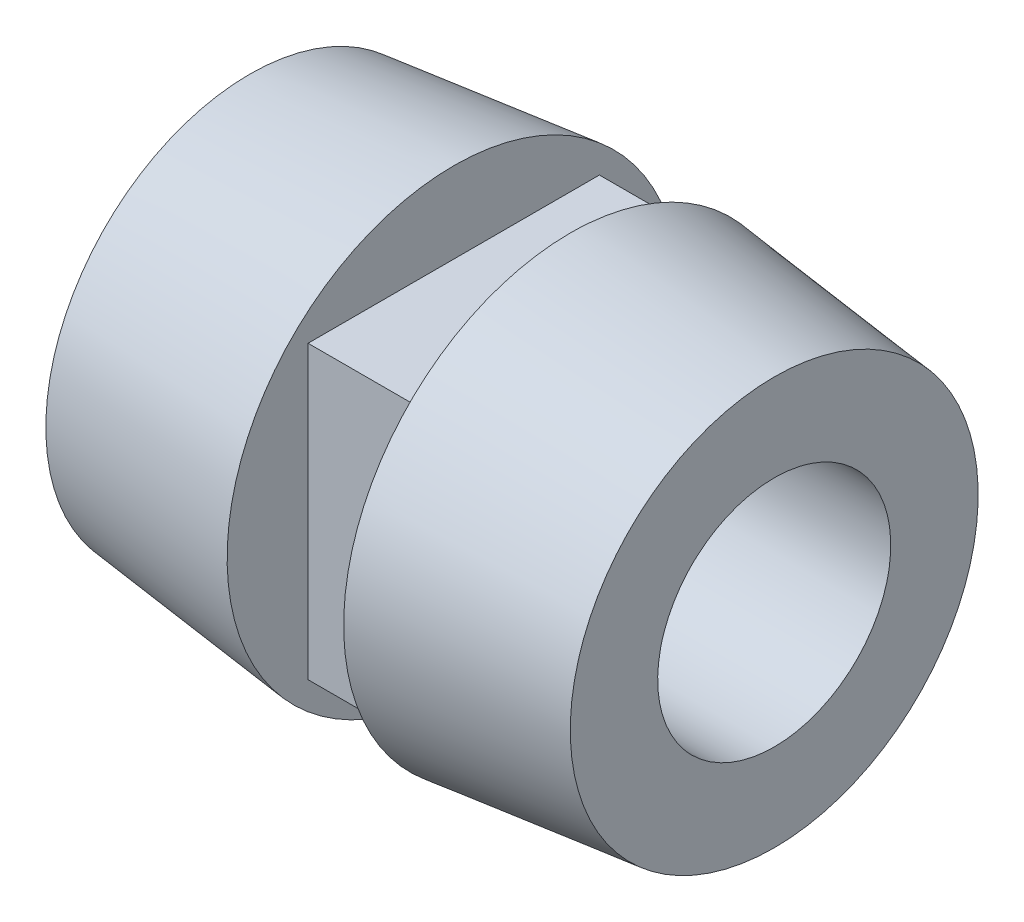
from build123d import *

# Parameters (mm, degrees)
ESQUISSE2_OUTSIDE_W          = 12.892
ESQUISSE2_OUTSIDE_H          = 12.892
ESQUISSE2_OUTSIDE_W_2        = 5
ESQUISSE2_OUTSIDE_H_2        = 5
ENL_V_MAT_EXTRU_1_DEPTH      = 1
ENL_V_MAT_EXTRU_2_DEPTH      = 8.106135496
ENL_V_MAT_EXTRU_2_DEPTH_BACK = 8.106135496
ESQUISSE4_R                  = 2


with BuildPart() as part:
    # Esquisse1 → R_volution4 (revolve)
    with BuildSketch(Plane.XY, mode=Mode.PRIVATE) as r_volution4_sk:
        Polygon((-4.5, 1.506e-05), (-4.5, 3.50001506), (0, 4), (4.5, 3.49998494), (4.5, -1.506e-05), align=None)
    revolve(r_volution4_sk.sketch.rotate(Axis((-15.161659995, 5.074e-05, 0), (0.9999999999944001, -3.346601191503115e-06, 0)), 180), axis=Axis((-15.161659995, 5.074e-05, 0), (0.9999999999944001, -3.346601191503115e-06, 0)))

    # Esquisse2 outside → Enl_v. mat.-Extru.1 (cut, symmetric)
    with BuildSketch(Plane(origin=(0, 0, 0), x_dir=(0, 0, -1), z_dir=(1, 0, 0))):
        Rectangle(ESQUISSE2_OUTSIDE_W, ESQUISSE2_OUTSIDE_H)
        Rectangle(ESQUISSE2_OUTSIDE_W_2, ESQUISSE2_OUTSIDE_H_2, mode=Mode.SUBTRACT)
    extrude(amount=ENL_V_MAT_EXTRU_1_DEPTH, both=True, mode=Mode.SUBTRACT)

    # Esquisse4 → Enl_v. mat.-Extru.2 (cut, two sides: drawn at the far end of the back side and taken through both)
    with BuildSketch(Plane(origin=(0, 0, 0), x_dir=(0, 0, -1), z_dir=(1, 0, 0)).offset(-ENL_V_MAT_EXTRU_2_DEPTH_BACK)):
        with Locations(Location((0, 0, 0), (0, 0, 270))):
            Circle(ESQUISSE4_R)
    extrude(amount=ENL_V_MAT_EXTRU_2_DEPTH + ENL_V_MAT_EXTRU_2_DEPTH_BACK, mode=Mode.SUBTRACT)


solid = part.part
